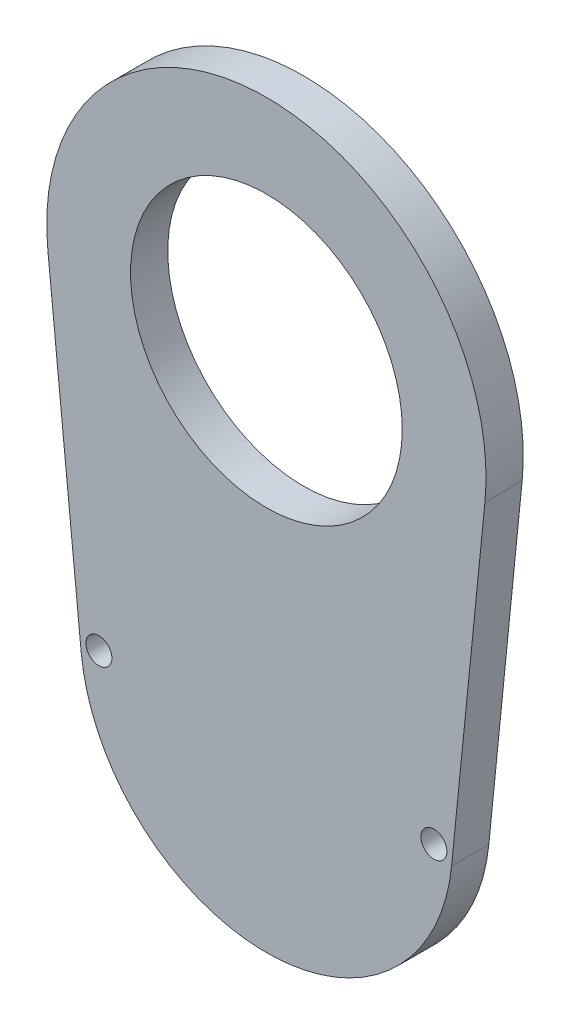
from build123d import *

# Parameters (mm, degrees)
SKETCH_COVER_R           = 0.889
SKETCH_COVER_R_2         = 9.271
BOSS_EXTRUDE_COVER_DEPTH = 2.54


with BuildPart() as part:
    # Sketch Cover → Boss-Extrude Cover (new body)
    with BuildSketch(Plane.XY):
        with BuildLine():
            ThreePointArc((-12.636340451, -24.13), (0, -35.56), (12.636340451, -24.13))
            Line((12.636340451, -24.13), (14.910881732, -1.4986))
            ThreePointArc((14.910881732, -1.4986), (0, 14.986), (-14.910881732, -1.4986))
            Line((-14.910881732, -1.4986), (-12.636340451, -24.13))
        make_face()
        with Locations((-11.43, -23.432935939)):
            Circle(SKETCH_COVER_R, mode=Mode.SUBTRACT)
        with Locations((11.43, -23.432935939)):
            Circle(SKETCH_COVER_R, mode=Mode.SUBTRACT)
        Circle(SKETCH_COVER_R_2, mode=Mode.SUBTRACT)
    extrude(amount=BOSS_EXTRUDE_COVER_DEPTH)


solid = part.part
